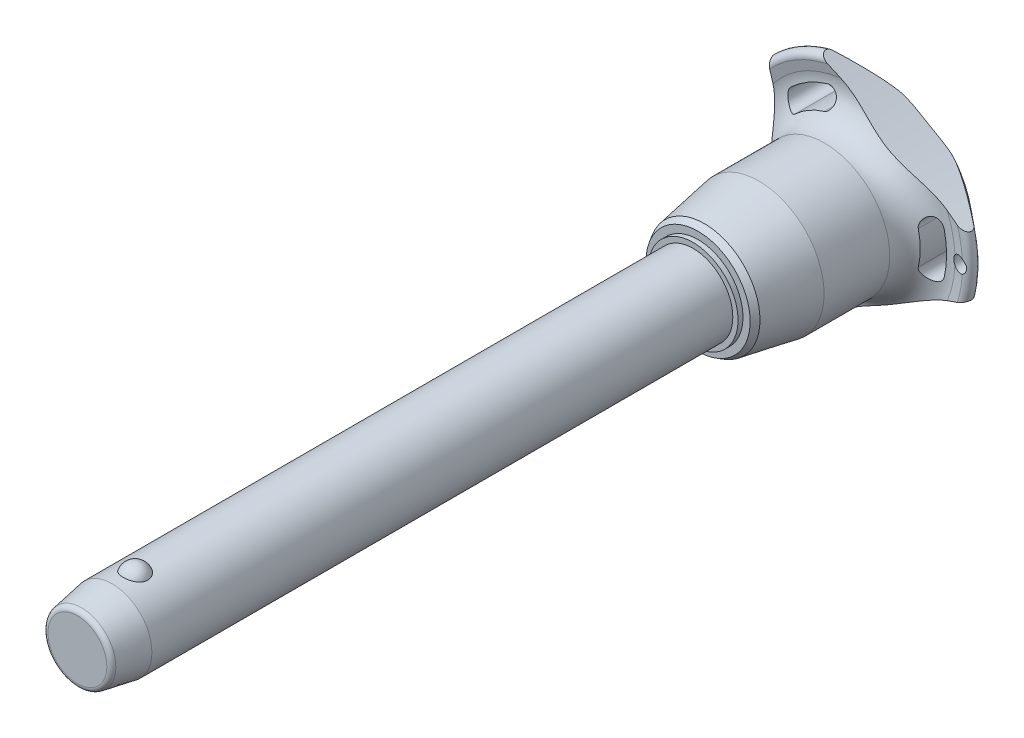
from build123d import *

# Parameters (mm, degrees)
SKETCH1_R           = 8
BOSS_EXTRUDE1_DEPTH = 110
SKETCH2_R           = 7
BOSS_EXTRUDE2_DEPTH = 39.7
BOSS_EXTRUDE3_START = 14
SKETCH1_2_R         = 8
BOSS_EXTRUDE3_DEPTH = 14
CHAMFER1_SIZE       = 7
CHAMFER1_SIZE2      = 1.234288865
FILLET1_R           = 1
SKETCH6_R           = 144.275
CUT_EXTRUDE1_DEPTH  = 154.440094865
CIRPATTERN1_COUNT   = 3
SKETCH7_R           = 1.5
CUT_EXTRUDE2_DEPTH  = 154.309245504


with BuildPart() as part:
    # Sketch1 → Boss-Extrude1 (new body)
    with BuildSketch(Plane.XY):
        Circle(SKETCH1_R)
    extrude(amount=-BOSS_EXTRUDE1_DEPTH)

    # Sketch2 → Boss-Extrude2 (add)
    with BuildSketch(Plane(origin=(0, 0, -110), x_dir=(-1, 0, 0), z_dir=(0, 0, -1))):
        Circle(SKETCH2_R)
    extrude(amount=BOSS_EXTRUDE2_DEPTH)

    # Sketch3 → Revolve1 (revolve)
    with BuildSketch(Plane(origin=(0, 0, 0), x_dir=(0, 0, -1), z_dir=(1, 0, 0))):
        with BuildLine():
            Line((-2.387467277, 9.5), (-2.387467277, 4.2))
            ThreePointArc((-2.387467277, 4.2), (0.262532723, 6.85), (-2.387467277, 9.5))
        make_face()
        with BuildLine():
            Line((-2.387467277, -4.2), (-2.387467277, -9.5))
            ThreePointArc((-2.387467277, -9.5), (0.262532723, -6.85), (-2.387467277, -4.2))
        make_face()
    revolve(axis=Axis((0, -4.2, 2.387467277), (0, 1, 0)))

    # Sketch1_2 → Boss-Extrude3 (add)
    with BuildSketch(Plane.XY.offset(BOSS_EXTRUDE3_START)):
        Circle(SKETCH1_2_R)
    extrude(amount=-BOSS_EXTRUDE3_DEPTH)

    # Chamfer1
    chamfer1_edges = [part.edges().sort_by_distance(p)[0] for p in [
        (-8, 0, 14),
    ]]
    chamfer1_side = [part.faces().sort_by_distance(p)[0] for p in [
        (-8, 0, -48),
    ]]
    chamfer(chamfer1_edges, length=CHAMFER1_SIZE, length2=CHAMFER1_SIZE2, reference=chamfer1_side[0])

    # Fillet1
    fillet1_edges = [part.edges().sort_by_distance(p)[0] for p in [
        (-6.765711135, 0, 14),
        (7, 0, -149.7),
    ]]
    fillet(fillet1_edges, radius=FILLET1_R)

    # Sketch4 → Revolve2 (revolve)
    with BuildSketch(Plane(origin=(0, 0, 0), x_dir=(0, 0, -1), z_dir=(1, 0, 0)), mode=Mode.PRIVATE) as revolve2_sk:
        Polygon((110, 0), (110, 9.044607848), (111, 9.044607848), (111, 10.490707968), (112.25235944, 11.213758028), (123.233333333, 13.15), (136.466666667, 13.15), (136.466666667, 0), align=None)
    revolve(revolve2_sk.sketch.rotate(Axis((0, 0, -136.466666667), (0, 0, 1)), 90), axis=Axis((0, 0, -136.466666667), (0, 0, 1)))

    # Sketch5 → Revolve3 (revolve)
    with BuildSketch(Plane(origin=(0, 0, 0), x_dir=(0, 0, -1), z_dir=(1, 0, 0)), mode=Mode.PRIVATE) as revolve3_sk:
        with BuildLine():
            Line((142.32877039, 20.428960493), (141.910912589, 22.344207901))
            ThreePointArc((141.910912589, 22.344207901), (142.554394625, 23.677136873), (144.002586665, 23.371345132))
            Line((144.002586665, 23.371345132), (149.141488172, 17.247040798))
            ThreePointArc((149.141488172, 17.247040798), (149.7, 15.584758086), (148.978803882, 13.986322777))
            ThreePointArc((148.978803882, 13.986322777), (144.617427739, 7.589034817), (143.083333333, 0))
            Line((143.083333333, 0), (136.466666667, 0))
            Line((136.466666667, 0), (136.466666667, 13.15))
            ThreePointArc((136.466666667, 13.15), (141.139661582, 15.38660811), (142.32877039, 20.428960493))
        make_face()
    revolve(revolve3_sk.sketch.rotate(Axis((0, 0, -143.083333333), (0, 0, 1)), 90), axis=Axis((0, 0, -143.083333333), (0, 0, 1)))

    # Sketch6 → Cut-Extrude1 (cut, through all)
    with BuildSketch(Plane.XY):
        with Locations((-159.975, 0)):
            Circle(SKETCH6_R)
        with BuildLine():
            ThreePointArc((18.131206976, -4.190753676), (18.60922037, 0), (18.131206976, 4.190753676))
            ThreePointArc((18.131206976, 4.190753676), (15.94840906, 5.553949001), (14.585213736, 3.371151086))
            ThreePointArc((14.585213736, 3.371151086), (14.969740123, 0), (14.585213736, -3.371151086))
            ThreePointArc((14.585213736, -3.371151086), (15.94840906, -5.553949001), (18.131206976, -4.190753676))
        make_face()
    cut_extrude1 = extrude(amount=-CUT_EXTRUDE1_DEPTH, mode=Mode.SUBTRACT)

    # CirPattern1: Cut-Extrude1 ×3 about axis
    cirpattern1_axis = Axis((0, 0, 0), (0, 0, 1))
    for i in range(1, CIRPATTERN1_COUNT):
        add(cut_extrude1.rotate(cirpattern1_axis, i * 360 / CIRPATTERN1_COUNT), mode=Mode.SUBTRACT)

    # Sketch7 → Cut-Extrude2 (cut, through all)
    with BuildSketch(Plane.XY):
        with Locations(Location((21.60922037, 0, 0), (0, 0, 297.620773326))):
            Circle(SKETCH7_R)
    extrude(amount=-CUT_EXTRUDE2_DEPTH, mode=Mode.SUBTRACT)


solid = part.part
